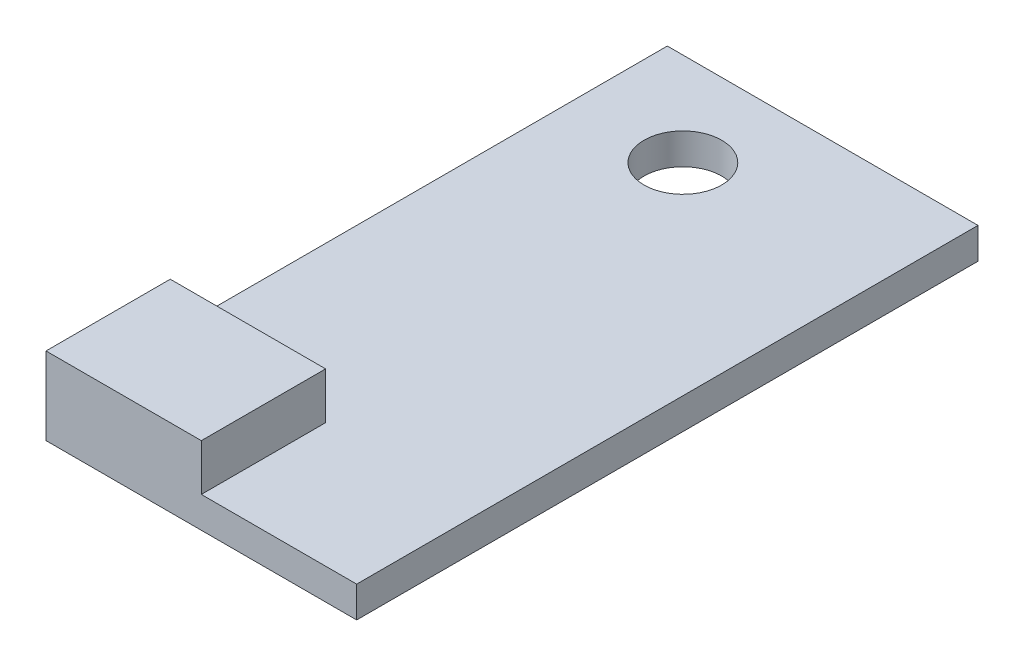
from build123d import *

# Parameters (mm, degrees)
SKETCH1_W                 = 100
SKETCH1_H                 = 200
EXTRUDE1_DEPTH            = 10
SKETCH2_W                 = 50
SKETCH2_H                 = 40
EXTRUDE2_DEPTH            = 25
M25_0_25_DIAMETER_HOLE1_D = 25


with BuildPart() as part:
    # Sketch1 → Extrude1 (new body)
    with BuildSketch(Plane(origin=(0, 0, 0), x_dir=(1, 0, 0), z_dir=(0, 1, 0))):
        with Locations((50, 100)):
            Rectangle(SKETCH1_W, SKETCH1_H)
    extrude(amount=EXTRUDE1_DEPTH)

    # Sketch2 → Extrude2 (add)
    with BuildSketch(Plane.XZ):
        with Locations((25, -20)):
            Rectangle(SKETCH2_W, SKETCH2_H)
    extrude(amount=-EXTRUDE2_DEPTH)

    # M25.0 _25_ Diameter Hole1 (through all)
    with Locations(Plane(origin=(0, 10, 0), x_dir=(-1, 0, 0), z_dir=(0, 1, 0))):
        with Locations((-35, -170)):
            Hole(M25_0_25_DIAMETER_HOLE1_D / 2)


solid = part.part
